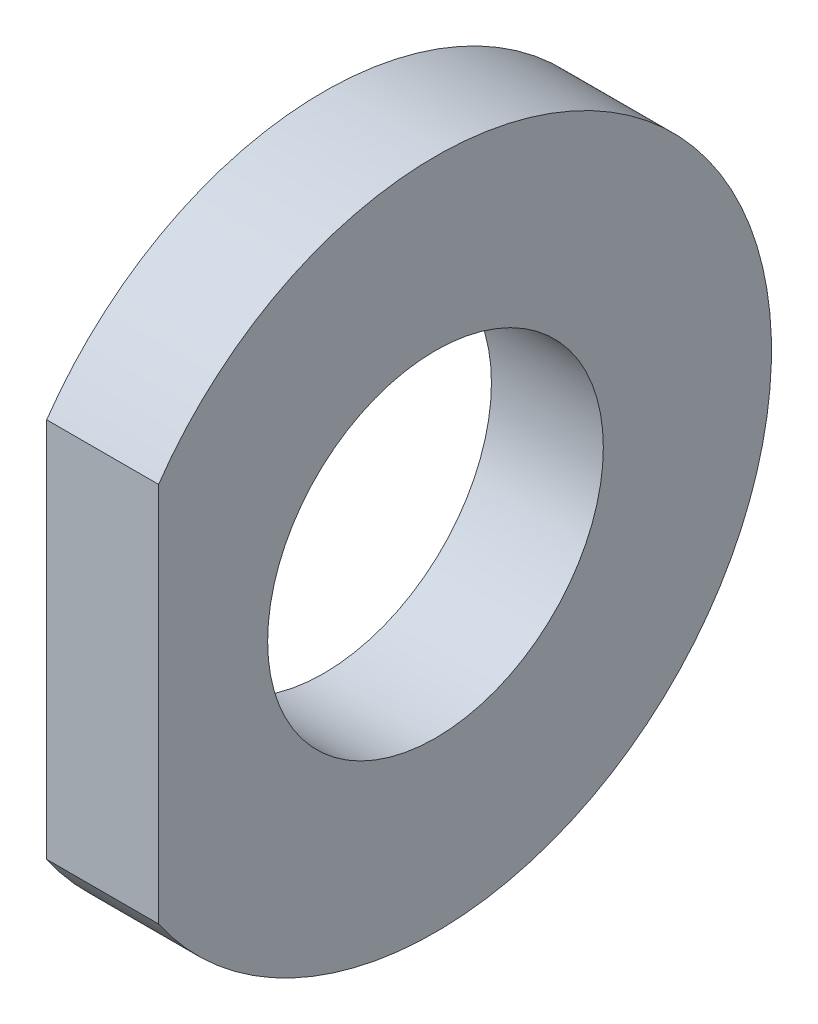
from build123d import *

# Parameters (mm, degrees)
SKETCH1_W = 4.4958
SKETCH1_H = 6.7564


with BuildPart() as part:
    # Sketch1 → Revolve1 (revolve)
    with BuildSketch(Plane.XY, mode=Mode.PRIVATE) as revolve1_sk:
        with Locations((-2.2479, 10.1219)):
            Rectangle(SKETCH1_W, SKETCH1_H)
    revolve(revolve1_sk.sketch.rotate(Axis((0, 0, 0), (-1, 0, 0)), 90), axis=Axis((0, 0, 0), (-1, 0, 0)))

    # SurfaceCut1
    split(bisect_by=Plane.XY.offset(11.1252), keep=Keep.BOTTOM)


solid = part.part
